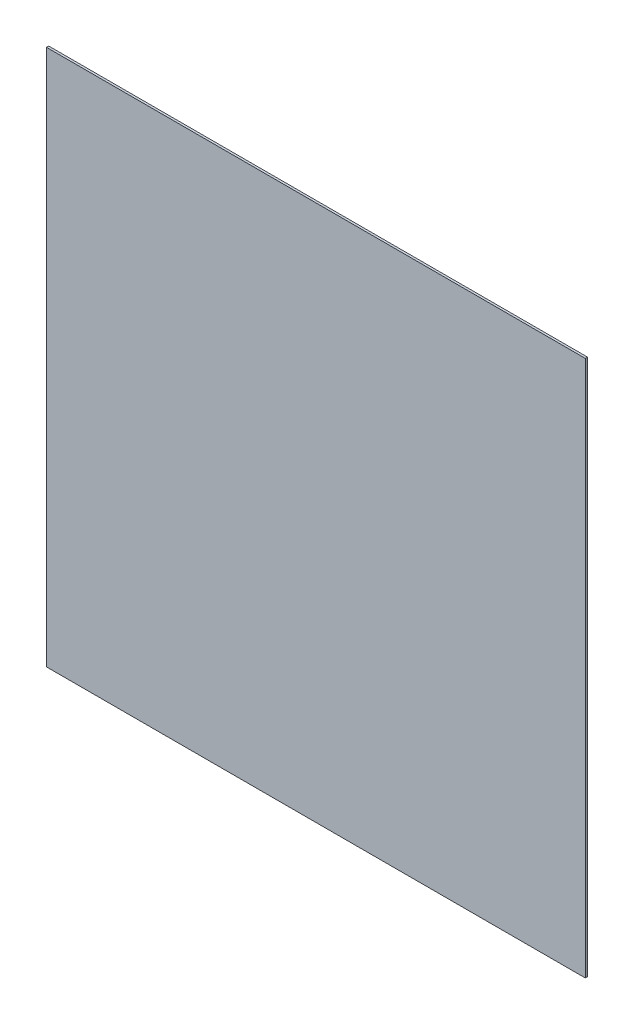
ISO-10303-21;
HEADER;
FILE_DESCRIPTION(('STEP AP214'),'2;1');
FILE_NAME('part.step','',(''),(''),'','','');
FILE_SCHEMA(('AUTOMOTIVE_DESIGN { 1 0 10303 214 1 1 1 1 }'));
ENDSEC;
DATA;
#1=APPLICATION_CONTEXT('core data for automotive mechanical design processes');
#2=APPLICATION_PROTOCOL_DEFINITION('international standard','automotive_design',2000,#1);
#3=PRODUCT_CONTEXT('',#1,'mechanical');
#4=PRODUCT('Part','Part','',(#3));
#5=PRODUCT_RELATED_PRODUCT_CATEGORY('part','',(#4));
#6=PRODUCT_DEFINITION_FORMATION('','',#4);
#7=PRODUCT_DEFINITION_CONTEXT('part definition',#1,'design');
#8=PRODUCT_DEFINITION('design','',#6,#7);
#9=PRODUCT_DEFINITION_SHAPE('','',#8);
#10=(LENGTH_UNIT() NAMED_UNIT(*) SI_UNIT(.MILLI.,.METRE.));
#11=(NAMED_UNIT(*) PLANE_ANGLE_UNIT() SI_UNIT($,.RADIAN.));
#12=(NAMED_UNIT(*) SI_UNIT($,.STERADIAN.) SOLID_ANGLE_UNIT());
#13=UNCERTAINTY_MEASURE_WITH_UNIT(LENGTH_MEASURE(1.E-05),#10,'distance_accuracy_value','');
#14=(GEOMETRIC_REPRESENTATION_CONTEXT(3) GLOBAL_UNCERTAINTY_ASSIGNED_CONTEXT((#13)) GLOBAL_UNIT_ASSIGNED_CONTEXT((#10,
#11,#12)) REPRESENTATION_CONTEXT('',''));
#15=CARTESIAN_POINT('',(0.,0.,0.));
#16=DIRECTION('',(0.,0.,1.));
#17=DIRECTION('',(1.,0.,0.));
#18=AXIS2_PLACEMENT_3D('',#15,#16,#17);
#19=CARTESIAN_POINT('',(2.53999999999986,-2.54000000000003,2.54));
#20=DIRECTION('',(-1.,0.,0.));
#21=DIRECTION('',(0.,0.,1.));
#22=AXIS2_PLACEMENT_3D('',#19,#20,#21);
#23=PLANE('',#22);
#24=DIRECTION('',(0.,1.,0.));
#25=VECTOR('',#24,1.);
#26=CARTESIAN_POINT('',(2.53999999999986,-2.54000000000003,0.));
#27=LINE('',#26,#25);
#28=CARTESIAN_POINT('',(2.53999999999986,-2.54000000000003,0.));
#29=VERTEX_POINT('',#28);
#30=CARTESIAN_POINT('',(2.53999999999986,609.599999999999,0.));
#31=VERTEX_POINT('',#30);
#32=EDGE_CURVE('E99',#29,#31,#27,.T.);
#33=ORIENTED_EDGE('',*,*,#32,.T.);
#34=DIRECTION('',(0.,0.,-1.));
#35=VECTOR('',#34,1.);
#36=CARTESIAN_POINT('',(2.53999999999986,609.599999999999,2.54));
#37=LINE('',#36,#35);
#38=CARTESIAN_POINT('',(2.53999999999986,609.599999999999,2.54));
#39=VERTEX_POINT('',#38);
#40=EDGE_CURVE('E11',#39,#31,#37,.T.);
#41=ORIENTED_EDGE('',*,*,#40,.F.);
#42=DIRECTION('',(0.,1.,0.));
#43=VECTOR('',#42,1.);
#44=CARTESIAN_POINT('',(2.53999999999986,-2.54000000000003,2.54));
#45=LINE('',#44,#43);
#46=CARTESIAN_POINT('',(2.53999999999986,-2.54000000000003,2.54));
#47=VERTEX_POINT('',#46);
#48=EDGE_CURVE('E87',#47,#39,#45,.T.);
#49=ORIENTED_EDGE('',*,*,#48,.F.);
#50=DIRECTION('',(0.,0.,-1.));
#51=VECTOR('',#50,1.);
#52=CARTESIAN_POINT('',(2.53999999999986,-2.54000000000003,2.54));
#53=LINE('',#52,#51);
#54=EDGE_CURVE('E95',#47,#29,#53,.T.);
#55=ORIENTED_EDGE('',*,*,#54,.T.);
#56=EDGE_LOOP('',(#33,#41,#49,#55));
#57=FACE_BOUND('',#56,.T.);
#58=ADVANCED_FACE('F36',(#57),#23,.F.);
#59=CARTESIAN_POINT('',(2.53999999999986,609.599999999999,2.54));
#60=DIRECTION('',(0.,-1.,0.));
#61=DIRECTION('',(0.,0.,-1.));
#62=AXIS2_PLACEMENT_3D('',#59,#60,#61);
#63=PLANE('',#62);
#64=DIRECTION('',(-1.,0.,0.));
#65=VECTOR('',#64,1.);
#66=CARTESIAN_POINT('',(2.53999999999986,609.599999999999,0.));
#67=LINE('',#66,#65);
#68=CARTESIAN_POINT('',(-612.14,609.599999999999,0.));
#69=VERTEX_POINT('',#68);
#70=EDGE_CURVE('E91',#31,#69,#67,.T.);
#71=ORIENTED_EDGE('',*,*,#70,.T.);
#72=DIRECTION('',(0.,0.,-1.));
#73=VECTOR('',#72,1.);
#74=CARTESIAN_POINT('',(-612.14,609.599999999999,2.54));
#75=LINE('',#74,#73);
#76=CARTESIAN_POINT('',(-612.14,609.599999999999,2.54));
#77=VERTEX_POINT('',#76);
#78=EDGE_CURVE('E44',#77,#69,#75,.T.);
#79=ORIENTED_EDGE('',*,*,#78,.F.);
#80=DIRECTION('',(-1.,0.,0.));
#81=VECTOR('',#80,1.);
#82=CARTESIAN_POINT('',(2.53999999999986,609.599999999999,2.54));
#83=LINE('',#82,#81);
#84=EDGE_CURVE('E82',#39,#77,#83,.T.);
#85=ORIENTED_EDGE('',*,*,#84,.F.);
#86=ORIENTED_EDGE('',*,*,#40,.T.);
#87=EDGE_LOOP('',(#71,#79,#85,#86));
#88=FACE_BOUND('',#87,.T.);
#89=ADVANCED_FACE('F90',(#88),#63,.F.);
#90=CARTESIAN_POINT('',(-612.14,-2.54000000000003,2.54));
#91=DIRECTION('',(1.,0.,0.));
#92=DIRECTION('',(0.,0.,-1.));
#93=AXIS2_PLACEMENT_3D('',#90,#91,#92);
#94=PLANE('',#93);
#95=DIRECTION('',(0.,-1.,0.));
#96=VECTOR('',#95,1.);
#97=CARTESIAN_POINT('',(-612.14,-2.54000000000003,0.));
#98=LINE('',#97,#96);
#99=CARTESIAN_POINT('',(-612.14,-2.54000000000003,0.));
#100=VERTEX_POINT('',#99);
#101=EDGE_CURVE('E69',#69,#100,#98,.T.);
#102=ORIENTED_EDGE('',*,*,#101,.T.);
#103=DIRECTION('',(0.,0.,-1.));
#104=VECTOR('',#103,1.);
#105=CARTESIAN_POINT('',(-612.14,-2.54000000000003,2.54));
#106=LINE('',#105,#104);
#107=CARTESIAN_POINT('',(-612.14,-2.54000000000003,2.54));
#108=VERTEX_POINT('',#107);
#109=EDGE_CURVE('E92',#108,#100,#106,.T.);
#110=ORIENTED_EDGE('',*,*,#109,.F.);
#111=DIRECTION('',(0.,-1.,0.));
#112=VECTOR('',#111,1.);
#113=CARTESIAN_POINT('',(-612.14,-2.54000000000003,2.54));
#114=LINE('',#113,#112);
#115=EDGE_CURVE('E85',#77,#108,#114,.T.);
#116=ORIENTED_EDGE('',*,*,#115,.F.);
#117=ORIENTED_EDGE('',*,*,#78,.T.);
#118=EDGE_LOOP('',(#102,#110,#116,#117));
#119=FACE_BOUND('',#118,.T.);
#120=ADVANCED_FACE('F93',(#119),#94,.F.);
#121=CARTESIAN_POINT('',(2.53999999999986,-2.54000000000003,2.54));
#122=DIRECTION('',(0.,1.,0.));
#123=DIRECTION('',(0.,0.,1.));
#124=AXIS2_PLACEMENT_3D('',#121,#122,#123);
#125=PLANE('',#124);
#126=DIRECTION('',(1.,0.,0.));
#127=VECTOR('',#126,1.);
#128=CARTESIAN_POINT('',(2.53999999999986,-2.54000000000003,0.));
#129=LINE('',#128,#127);
#130=EDGE_CURVE('E75',#100,#29,#129,.T.);
#131=ORIENTED_EDGE('',*,*,#130,.T.);
#132=ORIENTED_EDGE('',*,*,#54,.F.);
#133=DIRECTION('',(1.,0.,0.));
#134=VECTOR('',#133,1.);
#135=CARTESIAN_POINT('',(2.53999999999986,-2.54000000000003,2.54));
#136=LINE('',#135,#134);
#137=EDGE_CURVE('E52',#108,#47,#136,.T.);
#138=ORIENTED_EDGE('',*,*,#137,.F.);
#139=ORIENTED_EDGE('',*,*,#109,.T.);
#140=EDGE_LOOP('',(#131,#132,#138,#139));
#141=FACE_BOUND('',#140,.T.);
#142=ADVANCED_FACE('F106',(#141),#125,.F.);
#143=CARTESIAN_POINT('',(2.53999999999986,609.599999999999,2.54));
#144=DIRECTION('',(0.,0.,1.));
#145=DIRECTION('',(1.,0.,0.));
#146=AXIS2_PLACEMENT_3D('',#143,#144,#145);
#147=PLANE('',#146);
#148=ORIENTED_EDGE('',*,*,#48,.T.);
#149=ORIENTED_EDGE('',*,*,#84,.T.);
#150=ORIENTED_EDGE('',*,*,#115,.T.);
#151=ORIENTED_EDGE('',*,*,#137,.T.);
#152=EDGE_LOOP('',(#148,#149,#150,#151));
#153=FACE_BOUND('',#152,.T.);
#154=ADVANCED_FACE('F83',(#153),#147,.T.);
#155=CARTESIAN_POINT('',(2.53999999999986,609.599999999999,0.));
#156=DIRECTION('',(0.,0.,1.));
#157=DIRECTION('',(1.,0.,0.));
#158=AXIS2_PLACEMENT_3D('',#155,#156,#157);
#159=PLANE('',#158);
#160=ORIENTED_EDGE('',*,*,#32,.F.);
#161=ORIENTED_EDGE('',*,*,#130,.F.);
#162=ORIENTED_EDGE('',*,*,#101,.F.);
#163=ORIENTED_EDGE('',*,*,#70,.F.);
#164=EDGE_LOOP('',(#160,#161,#162,#163));
#165=FACE_BOUND('',#164,.T.);
#166=ADVANCED_FACE('F109',(#165),#159,.F.);
#167=CLOSED_SHELL('',(#58,#89,#120,#142,#154,#166));
#168=MANIFOLD_SOLID_BREP('B2',#167);
#169=ADVANCED_BREP_SHAPE_REPRESENTATION('',(#18,#168),#14);
#170=SHAPE_DEFINITION_REPRESENTATION(#9,#169);
ENDSEC;
END-ISO-10303-21;
